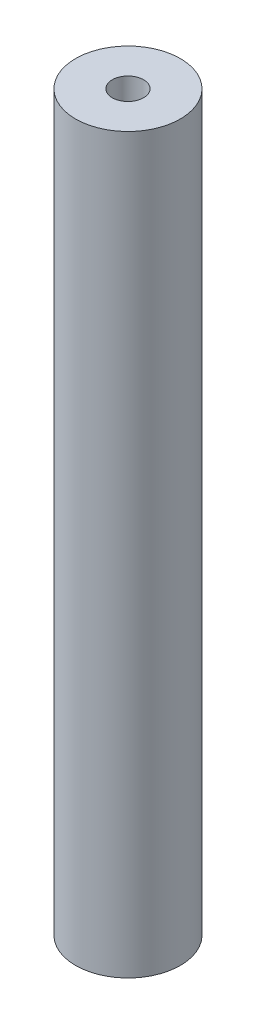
ISO-10303-21;
HEADER;
FILE_DESCRIPTION(('STEP AP214'),'2;1');
FILE_NAME('part.step','',(''),(''),'','','');
FILE_SCHEMA(('AUTOMOTIVE_DESIGN { 1 0 10303 214 1 1 1 1 }'));
ENDSEC;
DATA;
#1=APPLICATION_CONTEXT('core data for automotive mechanical design processes');
#2=APPLICATION_PROTOCOL_DEFINITION('international standard','automotive_design',2000,#1);
#3=PRODUCT_CONTEXT('',#1,'mechanical');
#4=PRODUCT('Part','Part','',(#3));
#5=PRODUCT_RELATED_PRODUCT_CATEGORY('part','',(#4));
#6=PRODUCT_DEFINITION_FORMATION('','',#4);
#7=PRODUCT_DEFINITION_CONTEXT('part definition',#1,'design');
#8=PRODUCT_DEFINITION('design','',#6,#7);
#9=PRODUCT_DEFINITION_SHAPE('','',#8);
#10=(LENGTH_UNIT() NAMED_UNIT(*) SI_UNIT(.MILLI.,.METRE.));
#11=(NAMED_UNIT(*) PLANE_ANGLE_UNIT() SI_UNIT($,.RADIAN.));
#12=(NAMED_UNIT(*) SI_UNIT($,.STERADIAN.) SOLID_ANGLE_UNIT());
#13=UNCERTAINTY_MEASURE_WITH_UNIT(LENGTH_MEASURE(1.E-05),#10,'distance_accuracy_value','');
#14=(GEOMETRIC_REPRESENTATION_CONTEXT(3) GLOBAL_UNCERTAINTY_ASSIGNED_CONTEXT((#13)) GLOBAL_UNIT_ASSIGNED_CONTEXT((#10,
#11,#12)) REPRESENTATION_CONTEXT('',''));
#15=CARTESIAN_POINT('',(0.,0.,0.));
#16=DIRECTION('',(0.,0.,1.));
#17=DIRECTION('',(1.,0.,0.));
#18=AXIS2_PLACEMENT_3D('',#15,#16,#17);
#19=CARTESIAN_POINT('',(0.,88.9,0.));
#20=DIRECTION('',(0.,-1.,0.));
#21=DIRECTION('',(0.,0.,-1.));
#22=AXIS2_PLACEMENT_3D('',#19,#20,#21);
#23=CYLINDRICAL_SURFACE('',#22,6.35);
#24=CARTESIAN_POINT('',(0.,88.9,0.));
#25=DIRECTION('',(0.,1.,0.));
#26=DIRECTION('',(0.,0.,1.));
#27=AXIS2_PLACEMENT_3D('',#24,#25,#26);
#28=CIRCLE('',#27,6.35);
#29=CARTESIAN_POINT('',(0.,88.9,6.35));
#30=VERTEX_POINT('',#29);
#31=EDGE_CURVE('E11',#30,#30,#28,.T.);
#32=ORIENTED_EDGE('',*,*,#31,.F.);
#33=EDGE_LOOP('',(#32));
#34=FACE_BOUND('',#33,.T.);
#35=CARTESIAN_POINT('',(0.,0.,0.));
#36=DIRECTION('',(0.,1.,0.));
#37=DIRECTION('',(0.,0.,1.));
#38=AXIS2_PLACEMENT_3D('',#35,#36,#37);
#39=CIRCLE('',#38,6.35);
#40=CARTESIAN_POINT('',(0.,0.,6.35));
#41=VERTEX_POINT('',#40);
#42=EDGE_CURVE('E42',#41,#41,#39,.T.);
#43=ORIENTED_EDGE('',*,*,#42,.T.);
#44=EDGE_LOOP('',(#43));
#45=FACE_BOUND('',#44,.T.);
#46=ADVANCED_FACE('F39',(#34,#45),#23,.T.);
#47=CARTESIAN_POINT('',(0.,88.9,0.));
#48=DIRECTION('',(0.,1.,0.));
#49=DIRECTION('',(0.,0.,1.));
#50=AXIS2_PLACEMENT_3D('',#47,#48,#49);
#51=PLANE('',#50);
#52=CARTESIAN_POINT('',(0.,88.9,0.));
#53=DIRECTION('',(0.,1.,0.));
#54=DIRECTION('',(0.,0.,1.));
#55=AXIS2_PLACEMENT_3D('',#52,#53,#54);
#56=CIRCLE('',#55,1.89865);
#57=CARTESIAN_POINT('',(0.,88.9,1.89865));
#58=VERTEX_POINT('',#57);
#59=EDGE_CURVE('E62',#58,#58,#56,.T.);
#60=ORIENTED_EDGE('',*,*,#59,.F.);
#61=EDGE_LOOP('',(#60));
#62=FACE_BOUND('',#61,.T.);
#63=ORIENTED_EDGE('',*,*,#31,.T.);
#64=EDGE_LOOP('',(#63));
#65=FACE_BOUND('',#64,.T.);
#66=ADVANCED_FACE('F81',(#62,#65),#51,.T.);
#67=CARTESIAN_POINT('',(0.,0.,0.));
#68=DIRECTION('',(0.,1.,0.));
#69=DIRECTION('',(0.,0.,1.));
#70=AXIS2_PLACEMENT_3D('',#67,#68,#69);
#71=PLANE('',#70);
#72=CARTESIAN_POINT('',(0.,0.,0.));
#73=DIRECTION('',(0.,-1.,0.));
#74=DIRECTION('',(0.,0.,-1.));
#75=AXIS2_PLACEMENT_3D('',#72,#73,#74);
#76=CIRCLE('',#75,2.5527);
#77=CARTESIAN_POINT('',(0.,0.,-2.5527));
#78=VERTEX_POINT('',#77);
#79=EDGE_CURVE('E63',#78,#78,#76,.T.);
#80=ORIENTED_EDGE('',*,*,#79,.F.);
#81=EDGE_LOOP('',(#80));
#82=FACE_BOUND('',#81,.T.);
#83=ORIENTED_EDGE('',*,*,#42,.F.);
#84=EDGE_LOOP('',(#83));
#85=FACE_BOUND('',#84,.T.);
#86=ADVANCED_FACE('F78',(#82,#85),#71,.F.);
#87=CARTESIAN_POINT('',(0.,73.914,0.));
#88=DIRECTION('',(0.,1.,0.));
#89=DIRECTION('',(0.,0.,1.));
#90=AXIS2_PLACEMENT_3D('',#87,#88,#89);
#91=CONICAL_SURFACE('',#90,1.89865,1.02974425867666);
#92=CARTESIAN_POINT('',(0.,72.7731759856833,0.));
#93=VERTEX_POINT('',#92);
#94=VERTEX_LOOP('',#93);
#95=FACE_BOUND('',#94,.T.);
#96=CARTESIAN_POINT('',(0.,73.914,0.));
#97=DIRECTION('',(0.,1.,0.));
#98=DIRECTION('',(0.,0.,1.));
#99=AXIS2_PLACEMENT_3D('',#96,#97,#98);
#100=CIRCLE('',#99,1.89865);
#101=CARTESIAN_POINT('',(0.,73.914,1.89865));
#102=VERTEX_POINT('',#101);
#103=EDGE_CURVE('E66',#102,#102,#100,.T.);
#104=ORIENTED_EDGE('',*,*,#103,.T.);
#105=EDGE_LOOP('',(#104));
#106=FACE_BOUND('',#105,.T.);
#107=ADVANCED_FACE('F80',(#95,#106),#91,.F.);
#108=CARTESIAN_POINT('',(0.,88.9,0.));
#109=DIRECTION('',(0.,1.,0.));
#110=DIRECTION('',(0.,0.,1.));
#111=AXIS2_PLACEMENT_3D('',#108,#109,#110);
#112=CYLINDRICAL_SURFACE('',#111,1.89865);
#113=ORIENTED_EDGE('',*,*,#103,.F.);
#114=EDGE_LOOP('',(#113));
#115=FACE_BOUND('',#114,.T.);
#116=ORIENTED_EDGE('',*,*,#59,.T.);
#117=EDGE_LOOP('',(#116));
#118=FACE_BOUND('',#117,.T.);
#119=ADVANCED_FACE('F56',(#115,#118),#112,.F.);
#120=CARTESIAN_POINT('',(0.,19.05,0.));
#121=DIRECTION('',(0.,-1.,0.));
#122=DIRECTION('',(0.,0.,-1.));
#123=AXIS2_PLACEMENT_3D('',#120,#121,#122);
#124=CONICAL_SURFACE('',#123,2.5527,1.02974425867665);
#125=CARTESIAN_POINT('',(0.,20.5838169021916,0.));
#126=VERTEX_POINT('',#125);
#127=VERTEX_LOOP('',#126);
#128=FACE_BOUND('',#127,.T.);
#129=CARTESIAN_POINT('',(0.,19.05,0.));
#130=DIRECTION('',(0.,-1.,0.));
#131=DIRECTION('',(0.,0.,-1.));
#132=AXIS2_PLACEMENT_3D('',#129,#130,#131);
#133=CIRCLE('',#132,2.5527);
#134=CARTESIAN_POINT('',(0.,19.05,-2.5527));
#135=VERTEX_POINT('',#134);
#136=EDGE_CURVE('E60',#135,#135,#133,.T.);
#137=ORIENTED_EDGE('',*,*,#136,.T.);
#138=EDGE_LOOP('',(#137));
#139=FACE_BOUND('',#138,.T.);
#140=ADVANCED_FACE('F52',(#128,#139),#124,.F.);
#141=CARTESIAN_POINT('',(0.,0.,0.));
#142=DIRECTION('',(0.,-1.,0.));
#143=DIRECTION('',(0.,0.,-1.));
#144=AXIS2_PLACEMENT_3D('',#141,#142,#143);
#145=CYLINDRICAL_SURFACE('',#144,2.5527);
#146=ORIENTED_EDGE('',*,*,#136,.F.);
#147=EDGE_LOOP('',(#146));
#148=FACE_BOUND('',#147,.T.);
#149=ORIENTED_EDGE('',*,*,#79,.T.);
#150=EDGE_LOOP('',(#149));
#151=FACE_BOUND('',#150,.T.);
#152=ADVANCED_FACE('F55',(#148,#151),#145,.F.);
#153=CLOSED_SHELL('',(#46,#66,#86,#107,#119,#140,#152));
#154=MANIFOLD_SOLID_BREP('B2',#153);
#155=ADVANCED_BREP_SHAPE_REPRESENTATION('',(#18,#154),#14);
#156=SHAPE_DEFINITION_REPRESENTATION(#9,#155);
ENDSEC;
END-ISO-10303-21;
